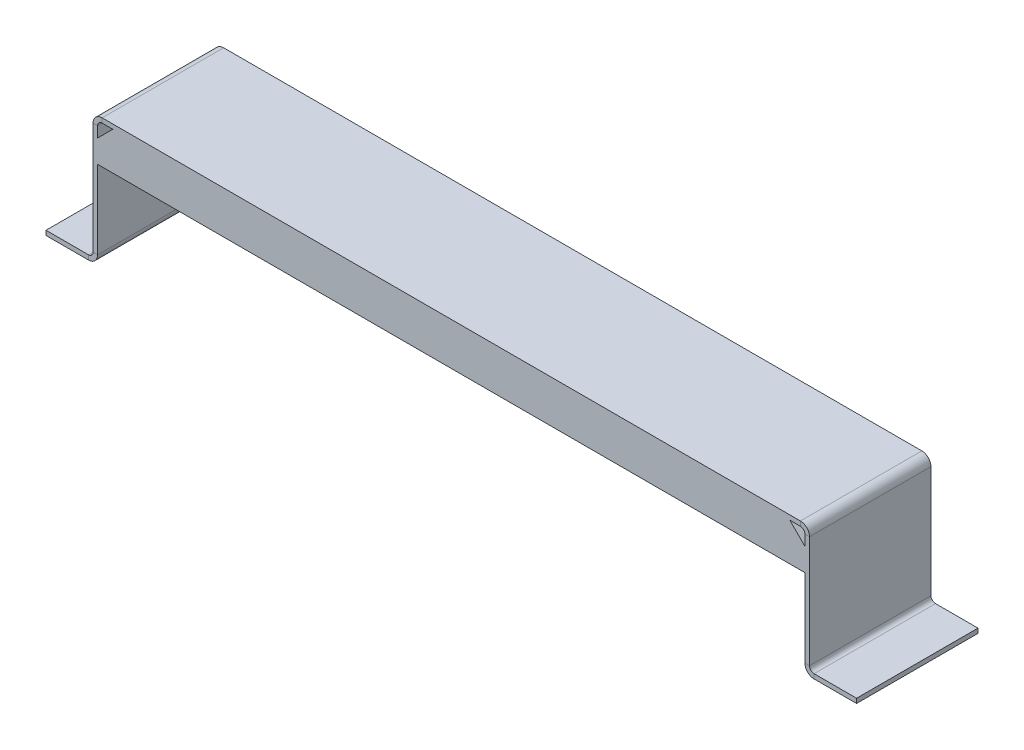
ISO-10303-21;
HEADER;
FILE_DESCRIPTION(('STEP AP214'),'2;1');
FILE_NAME('part.step','',(''),(''),'','','');
FILE_SCHEMA(('AUTOMOTIVE_DESIGN { 1 0 10303 214 1 1 1 1 }'));
ENDSEC;
DATA;
#1=APPLICATION_CONTEXT('core data for automotive mechanical design processes');
#2=APPLICATION_PROTOCOL_DEFINITION('international standard','automotive_design',2000,#1);
#3=PRODUCT_CONTEXT('',#1,'mechanical');
#4=PRODUCT('Part','Part','',(#3));
#5=PRODUCT_RELATED_PRODUCT_CATEGORY('part','',(#4));
#6=PRODUCT_DEFINITION_FORMATION('','',#4);
#7=PRODUCT_DEFINITION_CONTEXT('part definition',#1,'design');
#8=PRODUCT_DEFINITION('design','',#6,#7);
#9=PRODUCT_DEFINITION_SHAPE('','',#8);
#10=(LENGTH_UNIT() NAMED_UNIT(*) SI_UNIT(.MILLI.,.METRE.));
#11=(NAMED_UNIT(*) PLANE_ANGLE_UNIT() SI_UNIT($,.RADIAN.));
#12=(NAMED_UNIT(*) SI_UNIT($,.STERADIAN.) SOLID_ANGLE_UNIT());
#13=UNCERTAINTY_MEASURE_WITH_UNIT(LENGTH_MEASURE(1.E-05),#10,'distance_accuracy_value','');
#14=(GEOMETRIC_REPRESENTATION_CONTEXT(3) GLOBAL_UNCERTAINTY_ASSIGNED_CONTEXT((#13)) GLOBAL_UNIT_ASSIGNED_CONTEXT((#10,
#11,#12)) REPRESENTATION_CONTEXT('',''));
#15=CARTESIAN_POINT('',(0.,0.,0.));
#16=DIRECTION('',(0.,0.,1.));
#17=DIRECTION('',(1.,0.,0.));
#18=AXIS2_PLACEMENT_3D('',#15,#16,#17);
#19=CARTESIAN_POINT('',(42.,106.,-80.));
#20=DIRECTION('',(0.,0.,-1.));
#21=DIRECTION('',(-1.,0.,0.));
#22=AXIS2_PLACEMENT_3D('',#19,#20,#21);
#23=PLANE('',#22);
#24=DIRECTION('',(-1.,0.,0.));
#25=VECTOR('',#24,1.);
#26=CARTESIAN_POINT('',(42.,106.,-80.));
#27=LINE('',#26,#25);
#28=CARTESIAN_POINT('',(42.,106.,-80.));
#29=VERTEX_POINT('',#28);
#30=CARTESIAN_POINT('',(39.,106.,-80.));
#31=VERTEX_POINT('',#30);
#32=EDGE_CURVE('E11',#29,#31,#27,.T.);
#33=ORIENTED_EDGE('',*,*,#32,.F.);
#34=CARTESIAN_POINT('',(36.,106.,-80.));
#35=DIRECTION('',(0.,0.,-1.));
#36=DIRECTION('',(-1.,0.,0.));
#37=AXIS2_PLACEMENT_3D('',#34,#35,#36);
#38=CIRCLE('',#37,6.);
#39=CARTESIAN_POINT('',(36.,100.,-80.));
#40=VERTEX_POINT('',#39);
#41=EDGE_CURVE('E310',#29,#40,#38,.T.);
#42=ORIENTED_EDGE('',*,*,#41,.T.);
#43=DIRECTION('',(0.,-1.,0.));
#44=VECTOR('',#43,1.);
#45=CARTESIAN_POINT('',(36.,103.,-80.));
#46=LINE('',#45,#44);
#47=CARTESIAN_POINT('',(36.,103.,-80.));
#48=VERTEX_POINT('',#47);
#49=EDGE_CURVE('E33',#48,#40,#46,.T.);
#50=ORIENTED_EDGE('',*,*,#49,.F.);
#51=CARTESIAN_POINT('',(36.,106.,-80.));
#52=DIRECTION('',(0.,0.,1.));
#53=DIRECTION('',(1.,0.,0.));
#54=AXIS2_PLACEMENT_3D('',#51,#52,#53);
#55=CIRCLE('',#54,3.);
#56=EDGE_CURVE('E357',#31,#48,#55,.F.);
#57=ORIENTED_EDGE('',*,*,#56,.F.);
#58=EDGE_LOOP('',(#33,#42,#50,#57));
#59=FACE_BOUND('',#58,.T.);
#60=ADVANCED_FACE('F26',(#59),#23,.T.);
#61=CARTESIAN_POINT('',(36.,103.,-80.));
#62=DIRECTION('',(0.,0.,-1.));
#63=DIRECTION('',(-1.,0.,0.));
#64=AXIS2_PLACEMENT_3D('',#61,#62,#63);
#65=PLANE('',#64);
#66=DIRECTION('',(0.,-1.,0.));
#67=VECTOR('',#66,1.);
#68=CARTESIAN_POINT('',(42.,100.,-80.));
#69=LINE('',#68,#67);
#70=CARTESIAN_POINT('',(42.,179.630139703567,-80.));
#71=VERTEX_POINT('',#70);
#72=EDGE_CURVE('E313',#71,#29,#69,.T.);
#73=ORIENTED_EDGE('',*,*,#72,.T.);
#74=ORIENTED_EDGE('',*,*,#32,.T.);
#75=DIRECTION('',(0.,1.,0.));
#76=VECTOR('',#75,1.);
#77=CARTESIAN_POINT('',(39.,100.,-80.));
#78=LINE('',#77,#76);
#79=CARTESIAN_POINT('',(39.,179.630139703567,-80.));
#80=VERTEX_POINT('',#79);
#81=EDGE_CURVE('E354',#80,#31,#78,.F.);
#82=ORIENTED_EDGE('',*,*,#81,.F.);
#83=DIRECTION('',(1.,0.,0.));
#84=VECTOR('',#83,1.);
#85=CARTESIAN_POINT('',(39.,179.630139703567,-80.));
#86=LINE('',#85,#84);
#87=EDGE_CURVE('E437',#80,#71,#86,.T.);
#88=ORIENTED_EDGE('',*,*,#87,.T.);
#89=EDGE_LOOP('',(#73,#74,#82,#88));
#90=FACE_BOUND('',#89,.T.);
#91=ADVANCED_FACE('F479',(#90),#65,.T.);
#92=CARTESIAN_POINT('',(36.,100.,0.));
#93=DIRECTION('',(0.,0.,1.));
#94=DIRECTION('',(1.,0.,0.));
#95=AXIS2_PLACEMENT_3D('',#92,#93,#94);
#96=PLANE('',#95);
#97=DIRECTION('',(0.,1.,0.));
#98=VECTOR('',#97,1.);
#99=CARTESIAN_POINT('',(36.,100.,0.));
#100=LINE('',#99,#98);
#101=CARTESIAN_POINT('',(36.,100.,0.));
#102=VERTEX_POINT('',#101);
#103=CARTESIAN_POINT('',(36.,103.,0.));
#104=VERTEX_POINT('',#103);
#105=EDGE_CURVE('E444',#102,#104,#100,.T.);
#106=ORIENTED_EDGE('',*,*,#105,.F.);
#107=CARTESIAN_POINT('',(36.,106.,0.));
#108=DIRECTION('',(0.,0.,-1.));
#109=DIRECTION('',(-1.,0.,0.));
#110=AXIS2_PLACEMENT_3D('',#107,#108,#109);
#111=CIRCLE('',#110,6.);
#112=CARTESIAN_POINT('',(42.,106.,0.));
#113=VERTEX_POINT('',#112);
#114=EDGE_CURVE('E258',#113,#102,#111,.T.);
#115=ORIENTED_EDGE('',*,*,#114,.F.);
#116=DIRECTION('',(1.,0.,0.));
#117=VECTOR('',#116,1.);
#118=CARTESIAN_POINT('',(39.,106.,0.));
#119=LINE('',#118,#117);
#120=CARTESIAN_POINT('',(39.,106.,0.));
#121=VERTEX_POINT('',#120);
#122=EDGE_CURVE('E441',#121,#113,#119,.T.);
#123=ORIENTED_EDGE('',*,*,#122,.F.);
#124=CARTESIAN_POINT('',(36.,106.,0.));
#125=DIRECTION('',(0.,0.,1.));
#126=DIRECTION('',(1.,0.,0.));
#127=AXIS2_PLACEMENT_3D('',#124,#125,#126);
#128=CIRCLE('',#127,3.);
#129=EDGE_CURVE('E300',#121,#104,#128,.F.);
#130=ORIENTED_EDGE('',*,*,#129,.T.);
#131=EDGE_LOOP('',(#106,#115,#123,#130));
#132=FACE_BOUND('',#131,.T.);
#133=ADVANCED_FACE('F554',(#132),#96,.T.);
#134=CARTESIAN_POINT('',(39.,106.,0.));
#135=DIRECTION('',(0.,0.,1.));
#136=DIRECTION('',(1.,0.,0.));
#137=AXIS2_PLACEMENT_3D('',#134,#135,#136);
#138=PLANE('',#137);
#139=DIRECTION('',(-1.,0.,0.));
#140=VECTOR('',#139,1.);
#141=CARTESIAN_POINT('',(7.99999999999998,100.,0.));
#142=LINE('',#141,#140);
#143=CARTESIAN_POINT('',(7.99999999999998,100.,0.));
#144=VERTEX_POINT('',#143);
#145=EDGE_CURVE('E256',#102,#144,#142,.T.);
#146=ORIENTED_EDGE('',*,*,#145,.F.);
#147=ORIENTED_EDGE('',*,*,#105,.T.);
#148=DIRECTION('',(1.,0.,0.));
#149=VECTOR('',#148,1.);
#150=CARTESIAN_POINT('',(7.99999999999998,103.,0.));
#151=LINE('',#150,#149);
#152=CARTESIAN_POINT('',(7.99999999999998,103.,0.));
#153=VERTEX_POINT('',#152);
#154=EDGE_CURVE('E242',#104,#153,#151,.F.);
#155=ORIENTED_EDGE('',*,*,#154,.T.);
#156=DIRECTION('',(0.,1.,0.));
#157=VECTOR('',#156,1.);
#158=CARTESIAN_POINT('',(7.99999999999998,100.,0.));
#159=LINE('',#158,#157);
#160=EDGE_CURVE('E253',#144,#153,#159,.T.);
#161=ORIENTED_EDGE('',*,*,#160,.F.);
#162=EDGE_LOOP('',(#146,#147,#155,#161));
#163=FACE_BOUND('',#162,.T.);
#164=ADVANCED_FACE('F556',(#163),#138,.T.);
#165=CARTESIAN_POINT('',(44.9999999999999,182.630139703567,-80.));
#166=DIRECTION('',(0.,0.,-1.));
#167=DIRECTION('',(-1.,0.,0.));
#168=AXIS2_PLACEMENT_3D('',#165,#166,#167);
#169=PLANE('',#168);
#170=DIRECTION('',(0.,1.,0.));
#171=VECTOR('',#170,1.);
#172=CARTESIAN_POINT('',(44.9999999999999,182.630139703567,-80.));
#173=LINE('',#172,#171);
#174=CARTESIAN_POINT('',(44.9999999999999,182.630139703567,-80.));
#175=VERTEX_POINT('',#174);
#176=CARTESIAN_POINT('',(44.9999999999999,185.630139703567,-80.));
#177=VERTEX_POINT('',#176);
#178=EDGE_CURVE('E439',#175,#177,#173,.T.);
#179=ORIENTED_EDGE('',*,*,#178,.F.);
#180=CARTESIAN_POINT('',(44.9999999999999,179.630139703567,-80.));
#181=DIRECTION('',(0.,0.,1.));
#182=DIRECTION('',(1.,0.,0.));
#183=AXIS2_PLACEMENT_3D('',#180,#181,#182);
#184=CIRCLE('',#183,3.);
#185=EDGE_CURVE('E316',#175,#71,#184,.T.);
#186=ORIENTED_EDGE('',*,*,#185,.T.);
#187=ORIENTED_EDGE('',*,*,#87,.F.);
#188=CARTESIAN_POINT('',(44.9999999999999,179.630139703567,-80.));
#189=DIRECTION('',(0.,0.,1.));
#190=DIRECTION('',(1.,0.,0.));
#191=AXIS2_PLACEMENT_3D('',#188,#189,#190);
#192=CIRCLE('',#191,6.);
#193=EDGE_CURVE('E351',#177,#80,#192,.T.);
#194=ORIENTED_EDGE('',*,*,#193,.F.);
#195=EDGE_LOOP('',(#179,#186,#187,#194));
#196=FACE_BOUND('',#195,.T.);
#197=ADVANCED_FACE('F486',(#196),#169,.T.);
#198=CARTESIAN_POINT('',(39.,179.630139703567,-80.));
#199=DIRECTION('',(0.,0.,-1.));
#200=DIRECTION('',(-1.,0.,0.));
#201=AXIS2_PLACEMENT_3D('',#198,#199,#200);
#202=PLANE('',#201);
#203=DIRECTION('',(-1.,0.,0.));
#204=VECTOR('',#203,1.);
#205=CARTESIAN_POINT('',(508.000000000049,182.630139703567,-80.));
#206=LINE('',#205,#204);
#207=CARTESIAN_POINT('',(505.000000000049,182.630139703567,-80.));
#208=VERTEX_POINT('',#207);
#209=EDGE_CURVE('E319',#208,#175,#206,.T.);
#210=ORIENTED_EDGE('',*,*,#209,.T.);
#211=ORIENTED_EDGE('',*,*,#178,.T.);
#212=DIRECTION('',(1.,0.,0.));
#213=VECTOR('',#212,1.);
#214=CARTESIAN_POINT('',(508.000000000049,185.630139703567,-80.));
#215=LINE('',#214,#213);
#216=CARTESIAN_POINT('',(505.000000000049,185.630139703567,-80.));
#217=VERTEX_POINT('',#216);
#218=EDGE_CURVE('E348',#217,#177,#215,.F.);
#219=ORIENTED_EDGE('',*,*,#218,.F.);
#220=DIRECTION('',(0.,-1.,0.));
#221=VECTOR('',#220,1.);
#222=CARTESIAN_POINT('',(505.000000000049,185.630139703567,-80.));
#223=LINE('',#222,#221);
#224=EDGE_CURVE('E428',#217,#208,#223,.T.);
#225=ORIENTED_EDGE('',*,*,#224,.T.);
#226=EDGE_LOOP('',(#210,#211,#219,#225));
#227=FACE_BOUND('',#226,.T.);
#228=ADVANCED_FACE('F493',(#227),#202,.T.);
#229=CARTESIAN_POINT('',(42.,179.630139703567,0.));
#230=DIRECTION('',(0.,0.,1.));
#231=DIRECTION('',(1.,0.,0.));
#232=AXIS2_PLACEMENT_3D('',#229,#230,#231);
#233=PLANE('',#232);
#234=DIRECTION('',(-1.,0.,0.));
#235=VECTOR('',#234,1.);
#236=CARTESIAN_POINT('',(42.,179.630139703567,0.));
#237=LINE('',#236,#235);
#238=CARTESIAN_POINT('',(42.,179.630139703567,0.));
#239=VERTEX_POINT('',#238);
#240=CARTESIAN_POINT('',(39.,179.630139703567,0.));
#241=VERTEX_POINT('',#240);
#242=EDGE_CURVE('E435',#239,#241,#237,.T.);
#243=ORIENTED_EDGE('',*,*,#242,.F.);
#244=CARTESIAN_POINT('',(44.9999999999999,179.630139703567,0.));
#245=DIRECTION('',(0.,0.,1.));
#246=DIRECTION('',(1.,0.,0.));
#247=AXIS2_PLACEMENT_3D('',#244,#245,#246);
#248=CIRCLE('',#247,3.);
#249=CARTESIAN_POINT('',(44.9999999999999,182.630139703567,0.));
#250=VERTEX_POINT('',#249);
#251=EDGE_CURVE('E264',#250,#239,#248,.T.);
#252=ORIENTED_EDGE('',*,*,#251,.F.);
#253=DIRECTION('',(0.,-1.,0.));
#254=VECTOR('',#253,1.);
#255=CARTESIAN_POINT('',(44.9999999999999,185.630139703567,0.));
#256=LINE('',#255,#254);
#257=CARTESIAN_POINT('',(44.9999999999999,185.630139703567,0.));
#258=VERTEX_POINT('',#257);
#259=EDGE_CURVE('E432',#258,#250,#256,.T.);
#260=ORIENTED_EDGE('',*,*,#259,.F.);
#261=CARTESIAN_POINT('',(44.9999999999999,179.630139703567,0.));
#262=DIRECTION('',(0.,0.,1.));
#263=DIRECTION('',(1.,0.,0.));
#264=AXIS2_PLACEMENT_3D('',#261,#262,#263);
#265=CIRCLE('',#264,6.);
#266=EDGE_CURVE('E294',#258,#241,#265,.T.);
#267=ORIENTED_EDGE('',*,*,#266,.T.);
#268=EDGE_LOOP('',(#243,#252,#260,#267));
#269=FACE_BOUND('',#268,.T.);
#270=ADVANCED_FACE('F600',(#269),#233,.T.);
#271=CARTESIAN_POINT('',(508.000000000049,179.630139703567,-80.));
#272=DIRECTION('',(0.,0.,-1.));
#273=DIRECTION('',(-1.,0.,0.));
#274=AXIS2_PLACEMENT_3D('',#271,#272,#273);
#275=PLANE('',#274);
#276=DIRECTION('',(1.,0.,0.));
#277=VECTOR('',#276,1.);
#278=CARTESIAN_POINT('',(508.000000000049,179.630139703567,-80.));
#279=LINE('',#278,#277);
#280=CARTESIAN_POINT('',(508.000000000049,179.630139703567,-80.));
#281=VERTEX_POINT('',#280);
#282=CARTESIAN_POINT('',(511.000000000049,179.630139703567,-80.));
#283=VERTEX_POINT('',#282);
#284=EDGE_CURVE('E430',#281,#283,#279,.T.);
#285=ORIENTED_EDGE('',*,*,#284,.F.);
#286=CARTESIAN_POINT('',(505.000000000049,179.630139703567,-80.));
#287=DIRECTION('',(0.,0.,1.));
#288=DIRECTION('',(1.,0.,0.));
#289=AXIS2_PLACEMENT_3D('',#286,#287,#288);
#290=CIRCLE('',#289,3.);
#291=EDGE_CURVE('E322',#281,#208,#290,.T.);
#292=ORIENTED_EDGE('',*,*,#291,.T.);
#293=ORIENTED_EDGE('',*,*,#224,.F.);
#294=CARTESIAN_POINT('',(505.000000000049,179.630139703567,-80.));
#295=DIRECTION('',(0.,0.,1.));
#296=DIRECTION('',(1.,0.,0.));
#297=AXIS2_PLACEMENT_3D('',#294,#295,#296);
#298=CIRCLE('',#297,6.);
#299=EDGE_CURVE('E345',#283,#217,#298,.T.);
#300=ORIENTED_EDGE('',*,*,#299,.F.);
#301=EDGE_LOOP('',(#285,#292,#293,#300));
#302=FACE_BOUND('',#301,.T.);
#303=ADVANCED_FACE('F500',(#302),#275,.T.);
#304=CARTESIAN_POINT('',(505.000000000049,185.630139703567,-80.));
#305=DIRECTION('',(0.,0.,-1.));
#306=DIRECTION('',(-1.,0.,0.));
#307=AXIS2_PLACEMENT_3D('',#304,#305,#306);
#308=PLANE('',#307);
#309=DIRECTION('',(0.,1.,0.));
#310=VECTOR('',#309,1.);
#311=CARTESIAN_POINT('',(508.000000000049,100.000000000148,-80.));
#312=LINE('',#311,#310);
#313=CARTESIAN_POINT('',(508.000000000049,106.000000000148,-80.));
#314=VERTEX_POINT('',#313);
#315=EDGE_CURVE('E325',#314,#281,#312,.T.);
#316=ORIENTED_EDGE('',*,*,#315,.T.);
#317=ORIENTED_EDGE('',*,*,#284,.T.);
#318=DIRECTION('',(0.,1.,0.));
#319=VECTOR('',#318,1.);
#320=CARTESIAN_POINT('',(511.000000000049,100.000000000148,-80.));
#321=LINE('',#320,#319);
#322=CARTESIAN_POINT('',(511.000000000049,106.000000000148,-80.));
#323=VERTEX_POINT('',#322);
#324=EDGE_CURVE('E342',#323,#283,#321,.T.);
#325=ORIENTED_EDGE('',*,*,#324,.F.);
#326=DIRECTION('',(-1.,0.,0.));
#327=VECTOR('',#326,1.);
#328=CARTESIAN_POINT('',(511.000000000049,106.000000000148,-80.));
#329=LINE('',#328,#327);
#330=EDGE_CURVE('E421',#323,#314,#329,.T.);
#331=ORIENTED_EDGE('',*,*,#330,.T.);
#332=EDGE_LOOP('',(#316,#317,#325,#331));
#333=FACE_BOUND('',#332,.T.);
#334=ADVANCED_FACE('F507',(#333),#308,.T.);
#335=CARTESIAN_POINT('',(505.000000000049,182.630139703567,0.));
#336=DIRECTION('',(0.,0.,1.));
#337=DIRECTION('',(1.,0.,0.));
#338=AXIS2_PLACEMENT_3D('',#335,#336,#337);
#339=PLANE('',#338);
#340=DIRECTION('',(0.,1.,0.));
#341=VECTOR('',#340,1.);
#342=CARTESIAN_POINT('',(505.000000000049,182.630139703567,0.));
#343=LINE('',#342,#341);
#344=CARTESIAN_POINT('',(505.000000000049,182.630139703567,0.));
#345=VERTEX_POINT('',#344);
#346=CARTESIAN_POINT('',(505.000000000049,185.630139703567,0.));
#347=VERTEX_POINT('',#346);
#348=EDGE_CURVE('E426',#345,#347,#343,.T.);
#349=ORIENTED_EDGE('',*,*,#348,.F.);
#350=CARTESIAN_POINT('',(505.000000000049,179.630139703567,0.));
#351=DIRECTION('',(0.,0.,1.));
#352=DIRECTION('',(1.,0.,0.));
#353=AXIS2_PLACEMENT_3D('',#350,#351,#352);
#354=CIRCLE('',#353,3.);
#355=CARTESIAN_POINT('',(508.000000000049,179.630139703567,0.));
#356=VERTEX_POINT('',#355);
#357=EDGE_CURVE('E207',#356,#345,#354,.T.);
#358=ORIENTED_EDGE('',*,*,#357,.F.);
#359=DIRECTION('',(-1.,0.,0.));
#360=VECTOR('',#359,1.);
#361=CARTESIAN_POINT('',(511.000000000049,179.630139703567,0.));
#362=LINE('',#361,#360);
#363=CARTESIAN_POINT('',(511.000000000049,179.630139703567,0.));
#364=VERTEX_POINT('',#363);
#365=EDGE_CURVE('E203',#364,#356,#362,.T.);
#366=ORIENTED_EDGE('',*,*,#365,.F.);
#367=CARTESIAN_POINT('',(505.000000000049,179.630139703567,0.));
#368=DIRECTION('',(0.,0.,1.));
#369=DIRECTION('',(1.,0.,0.));
#370=AXIS2_PLACEMENT_3D('',#367,#368,#369);
#371=CIRCLE('',#370,6.);
#372=EDGE_CURVE('E288',#364,#347,#371,.T.);
#373=ORIENTED_EDGE('',*,*,#372,.T.);
#374=EDGE_LOOP('',(#349,#358,#366,#373));
#375=FACE_BOUND('',#374,.T.);
#376=ADVANCED_FACE('F628',(#375),#339,.T.);
#377=CARTESIAN_POINT('',(514.000000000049,100.000000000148,-80.));
#378=DIRECTION('',(0.,0.,-1.));
#379=DIRECTION('',(-1.,0.,0.));
#380=AXIS2_PLACEMENT_3D('',#377,#378,#379);
#381=PLANE('',#380);
#382=DIRECTION('',(0.,1.,0.));
#383=VECTOR('',#382,1.);
#384=CARTESIAN_POINT('',(514.000000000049,100.000000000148,-80.));
#385=LINE('',#384,#383);
#386=CARTESIAN_POINT('',(514.000000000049,100.000000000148,-80.));
#387=VERTEX_POINT('',#386);
#388=CARTESIAN_POINT('',(514.000000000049,103.000000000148,-80.));
#389=VERTEX_POINT('',#388);
#390=EDGE_CURVE('E423',#387,#389,#385,.T.);
#391=ORIENTED_EDGE('',*,*,#390,.F.);
#392=CARTESIAN_POINT('',(514.000000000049,106.000000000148,-80.));
#393=DIRECTION('',(0.,0.,-1.));
#394=DIRECTION('',(-1.,0.,0.));
#395=AXIS2_PLACEMENT_3D('',#392,#393,#394);
#396=CIRCLE('',#395,6.);
#397=EDGE_CURVE('E328',#387,#314,#396,.T.);
#398=ORIENTED_EDGE('',*,*,#397,.T.);
#399=ORIENTED_EDGE('',*,*,#330,.F.);
#400=CARTESIAN_POINT('',(514.000000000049,106.000000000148,-80.));
#401=DIRECTION('',(0.,0.,1.));
#402=DIRECTION('',(1.,0.,0.));
#403=AXIS2_PLACEMENT_3D('',#400,#401,#402);
#404=CIRCLE('',#403,3.);
#405=EDGE_CURVE('E339',#389,#323,#404,.F.);
#406=ORIENTED_EDGE('',*,*,#405,.F.);
#407=EDGE_LOOP('',(#391,#398,#399,#406));
#408=FACE_BOUND('',#407,.T.);
#409=ADVANCED_FACE('F514',(#408),#381,.T.);
#410=CARTESIAN_POINT('',(511.000000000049,106.000000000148,-80.));
#411=DIRECTION('',(0.,0.,-1.));
#412=DIRECTION('',(-1.,0.,0.));
#413=AXIS2_PLACEMENT_3D('',#410,#411,#412);
#414=PLANE('',#413);
#415=DIRECTION('',(-1.,0.,0.));
#416=VECTOR('',#415,1.);
#417=CARTESIAN_POINT('',(542.000000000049,100.000000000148,-80.));
#418=LINE('',#417,#416);
#419=CARTESIAN_POINT('',(542.000000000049,100.000000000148,-80.));
#420=VERTEX_POINT('',#419);
#421=EDGE_CURVE('E331',#420,#387,#418,.T.);
#422=ORIENTED_EDGE('',*,*,#421,.T.);
#423=ORIENTED_EDGE('',*,*,#390,.T.);
#424=DIRECTION('',(-1.,0.,0.));
#425=VECTOR('',#424,1.);
#426=CARTESIAN_POINT('',(542.000000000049,103.000000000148,-80.));
#427=LINE('',#426,#425);
#428=CARTESIAN_POINT('',(542.000000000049,103.000000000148,-80.));
#429=VERTEX_POINT('',#428);
#430=EDGE_CURVE('E336',#429,#389,#427,.T.);
#431=ORIENTED_EDGE('',*,*,#430,.F.);
#432=DIRECTION('',(0.,-1.,0.));
#433=VECTOR('',#432,1.);
#434=CARTESIAN_POINT('',(542.000000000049,103.000000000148,-80.));
#435=LINE('',#434,#433);
#436=EDGE_CURVE('E334',#429,#420,#435,.T.);
#437=ORIENTED_EDGE('',*,*,#436,.T.);
#438=EDGE_LOOP('',(#422,#423,#431,#437));
#439=FACE_BOUND('',#438,.T.);
#440=ADVANCED_FACE('F521',(#439),#414,.T.);
#441=CARTESIAN_POINT('',(508.000000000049,106.000000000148,0.));
#442=DIRECTION('',(0.,0.,1.));
#443=DIRECTION('',(1.,0.,0.));
#444=AXIS2_PLACEMENT_3D('',#441,#442,#443);
#445=PLANE('',#444);
#446=DIRECTION('',(1.,0.,0.));
#447=VECTOR('',#446,1.);
#448=CARTESIAN_POINT('',(508.000000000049,106.000000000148,0.));
#449=LINE('',#448,#447);
#450=CARTESIAN_POINT('',(508.000000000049,106.000000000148,0.));
#451=VERTEX_POINT('',#450);
#452=CARTESIAN_POINT('',(511.000000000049,106.000000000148,0.));
#453=VERTEX_POINT('',#452);
#454=EDGE_CURVE('E419',#451,#453,#449,.T.);
#455=ORIENTED_EDGE('',*,*,#454,.F.);
#456=CARTESIAN_POINT('',(514.000000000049,106.000000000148,0.));
#457=DIRECTION('',(0.,0.,-1.));
#458=DIRECTION('',(-1.,0.,0.));
#459=AXIS2_PLACEMENT_3D('',#456,#457,#458);
#460=CIRCLE('',#459,6.);
#461=CARTESIAN_POINT('',(514.000000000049,100.000000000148,0.));
#462=VERTEX_POINT('',#461);
#463=EDGE_CURVE('E272',#462,#451,#460,.T.);
#464=ORIENTED_EDGE('',*,*,#463,.F.);
#465=DIRECTION('',(0.,-1.,0.));
#466=VECTOR('',#465,1.);
#467=CARTESIAN_POINT('',(514.000000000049,103.000000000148,0.));
#468=LINE('',#467,#466);
#469=CARTESIAN_POINT('',(514.000000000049,103.000000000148,0.));
#470=VERTEX_POINT('',#469);
#471=EDGE_CURVE('E364',#470,#462,#468,.T.);
#472=ORIENTED_EDGE('',*,*,#471,.F.);
#473=CARTESIAN_POINT('',(514.000000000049,106.000000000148,0.));
#474=DIRECTION('',(0.,0.,1.));
#475=DIRECTION('',(1.,0.,0.));
#476=AXIS2_PLACEMENT_3D('',#473,#474,#475);
#477=CIRCLE('',#476,3.);
#478=EDGE_CURVE('E283',#470,#453,#477,.F.);
#479=ORIENTED_EDGE('',*,*,#478,.T.);
#480=EDGE_LOOP('',(#455,#464,#472,#479));
#481=FACE_BOUND('',#480,.T.);
#482=ADVANCED_FACE('F656',(#481),#445,.T.);
#483=CARTESIAN_POINT('',(514.000000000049,103.000000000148,0.));
#484=DIRECTION('',(0.,0.,1.));
#485=DIRECTION('',(1.,0.,0.));
#486=AXIS2_PLACEMENT_3D('',#483,#484,#485);
#487=PLANE('',#486);
#488=DIRECTION('',(0.,1.,0.));
#489=VECTOR('',#488,1.);
#490=CARTESIAN_POINT('',(508.000000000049,100.000000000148,0.));
#491=LINE('',#490,#489);
#492=CARTESIAN_POINT('',(508.000000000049,157.630139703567,0.));
#493=VERTEX_POINT('',#492);
#494=EDGE_CURVE('E206',#451,#493,#491,.T.);
#495=ORIENTED_EDGE('',*,*,#494,.F.);
#496=ORIENTED_EDGE('',*,*,#454,.T.);
#497=DIRECTION('',(0.,1.,0.));
#498=VECTOR('',#497,1.);
#499=CARTESIAN_POINT('',(511.000000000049,100.000000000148,0.));
#500=LINE('',#499,#498);
#501=EDGE_CURVE('E286',#453,#364,#500,.T.);
#502=ORIENTED_EDGE('',*,*,#501,.T.);
#503=ORIENTED_EDGE('',*,*,#365,.T.);
#504=CARTESIAN_POINT('',(508.000000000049,172.630139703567,0.));
#505=VERTEX_POINT('',#504);
#506=EDGE_CURVE('E196',#505,#356,#491,.T.);
#507=ORIENTED_EDGE('',*,*,#506,.F.);
#508=DIRECTION('',(-0.707106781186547,0.707106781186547,0.));
#509=VECTOR('',#508,1.);
#510=CARTESIAN_POINT('',(498.000000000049,182.630139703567,0.));
#511=LINE('',#510,#509);
#512=CARTESIAN_POINT('',(498.000000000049,182.630139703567,0.));
#513=VERTEX_POINT('',#512);
#514=EDGE_CURVE('E201',#505,#513,#511,.T.);
#515=ORIENTED_EDGE('',*,*,#514,.T.);
#516=DIRECTION('',(-1.,0.,0.));
#517=VECTOR('',#516,1.);
#518=CARTESIAN_POINT('',(508.000000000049,182.630139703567,0.));
#519=LINE('',#518,#517);
#520=EDGE_CURVE('E268',#345,#513,#519,.T.);
#521=ORIENTED_EDGE('',*,*,#520,.F.);
#522=ORIENTED_EDGE('',*,*,#348,.T.);
#523=DIRECTION('',(1.,0.,0.));
#524=VECTOR('',#523,1.);
#525=CARTESIAN_POINT('',(508.000000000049,185.630139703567,0.));
#526=LINE('',#525,#524);
#527=EDGE_CURVE('E291',#347,#258,#526,.F.);
#528=ORIENTED_EDGE('',*,*,#527,.T.);
#529=ORIENTED_EDGE('',*,*,#259,.T.);
#530=CARTESIAN_POINT('',(52.,182.630139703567,0.));
#531=VERTEX_POINT('',#530);
#532=EDGE_CURVE('E267',#531,#250,#519,.T.);
#533=ORIENTED_EDGE('',*,*,#532,.F.);
#534=DIRECTION('',(-0.707106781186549,-0.707106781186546,0.));
#535=VECTOR('',#534,1.);
#536=CARTESIAN_POINT('',(42.,172.630139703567,0.));
#537=LINE('',#536,#535);
#538=CARTESIAN_POINT('',(42.,172.630139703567,0.));
#539=VERTEX_POINT('',#538);
#540=EDGE_CURVE('E218',#531,#539,#537,.T.);
#541=ORIENTED_EDGE('',*,*,#540,.T.);
#542=DIRECTION('',(0.,-1.,0.));
#543=VECTOR('',#542,1.);
#544=CARTESIAN_POINT('',(42.,100.,0.));
#545=LINE('',#544,#543);
#546=EDGE_CURVE('E262',#239,#539,#545,.T.);
#547=ORIENTED_EDGE('',*,*,#546,.F.);
#548=ORIENTED_EDGE('',*,*,#242,.T.);
#549=DIRECTION('',(0.,1.,0.));
#550=VECTOR('',#549,1.);
#551=CARTESIAN_POINT('',(39.,100.,0.));
#552=LINE('',#551,#550);
#553=EDGE_CURVE('E297',#241,#121,#552,.F.);
#554=ORIENTED_EDGE('',*,*,#553,.T.);
#555=ORIENTED_EDGE('',*,*,#122,.T.);
#556=CARTESIAN_POINT('',(42.,157.630139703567,0.));
#557=VERTEX_POINT('',#556);
#558=EDGE_CURVE('E261',#557,#113,#545,.T.);
#559=ORIENTED_EDGE('',*,*,#558,.F.);
#560=DIRECTION('',(1.,0.,0.));
#561=VECTOR('',#560,1.);
#562=CARTESIAN_POINT('',(508.000000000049,157.630139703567,0.));
#563=LINE('',#562,#561);
#564=EDGE_CURVE('E219',#557,#493,#563,.T.);
#565=ORIENTED_EDGE('',*,*,#564,.T.);
#566=EDGE_LOOP('',(#495,#496,#502,#503,#507,#515,#521,#522,#528,#529,#533,#541,#547,#548,#554,
#555,#559,#565));
#567=FACE_BOUND('',#566,.T.);
#568=ADVANCED_FACE('F198',(#567),#487,.T.);
#569=CARTESIAN_POINT('',(7.99999999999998,103.,-80.));
#570=DIRECTION('',(0.,1.,0.));
#571=DIRECTION('',(0.,0.,1.));
#572=AXIS2_PLACEMENT_3D('',#569,#570,#571);
#573=PLANE('',#572);
#574=ORIENTED_EDGE('',*,*,#154,.F.);
#575=DIRECTION('',(0.,0.,1.));
#576=VECTOR('',#575,1.);
#577=CARTESIAN_POINT('',(36.,103.,-80.));
#578=LINE('',#577,#576);
#579=EDGE_CURVE('E361',#48,#104,#578,.T.);
#580=ORIENTED_EDGE('',*,*,#579,.F.);
#581=DIRECTION('',(1.,0.,0.));
#582=VECTOR('',#581,1.);
#583=CARTESIAN_POINT('',(7.99999999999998,103.,-80.));
#584=LINE('',#583,#582);
#585=CARTESIAN_POINT('',(7.99999999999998,103.,-80.));
#586=VERTEX_POINT('',#585);
#587=EDGE_CURVE('E303',#48,#586,#584,.F.);
#588=ORIENTED_EDGE('',*,*,#587,.T.);
#589=DIRECTION('',(0.,0.,1.));
#590=VECTOR('',#589,1.);
#591=CARTESIAN_POINT('',(7.99999999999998,103.,-80.));
#592=LINE('',#591,#590);
#593=EDGE_CURVE('E360',#586,#153,#592,.T.);
#594=ORIENTED_EDGE('',*,*,#593,.T.);
#595=EDGE_LOOP('',(#574,#580,#588,#594));
#596=FACE_BOUND('',#595,.T.);
#597=ADVANCED_FACE('F468',(#596),#573,.T.);
#598=CARTESIAN_POINT('',(36.,106.,-80.));
#599=DIRECTION('',(0.,0.,1.));
#600=DIRECTION('',(1.,0.,0.));
#601=AXIS2_PLACEMENT_3D('',#598,#599,#600);
#602=CYLINDRICAL_SURFACE('',#601,3.);
#603=ORIENTED_EDGE('',*,*,#129,.F.);
#604=DIRECTION('',(0.,0.,1.));
#605=VECTOR('',#604,1.);
#606=CARTESIAN_POINT('',(39.,106.,-80.));
#607=LINE('',#606,#605);
#608=EDGE_CURVE('E365',#31,#121,#607,.T.);
#609=ORIENTED_EDGE('',*,*,#608,.F.);
#610=ORIENTED_EDGE('',*,*,#56,.T.);
#611=ORIENTED_EDGE('',*,*,#579,.T.);
#612=EDGE_LOOP('',(#603,#609,#610,#611));
#613=FACE_BOUND('',#612,.T.);
#614=ADVANCED_FACE('F471',(#613),#602,.F.);
#615=CARTESIAN_POINT('',(39.,100.,-80.));
#616=DIRECTION('',(-1.,0.,0.));
#617=DIRECTION('',(0.,0.,1.));
#618=AXIS2_PLACEMENT_3D('',#615,#616,#617);
#619=PLANE('',#618);
#620=ORIENTED_EDGE('',*,*,#553,.F.);
#621=DIRECTION('',(0.,0.,1.));
#622=VECTOR('',#621,1.);
#623=CARTESIAN_POINT('',(39.,179.630139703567,-80.));
#624=LINE('',#623,#622);
#625=EDGE_CURVE('E368',#80,#241,#624,.T.);
#626=ORIENTED_EDGE('',*,*,#625,.F.);
#627=ORIENTED_EDGE('',*,*,#81,.T.);
#628=ORIENTED_EDGE('',*,*,#608,.T.);
#629=EDGE_LOOP('',(#620,#626,#627,#628));
#630=FACE_BOUND('',#629,.T.);
#631=ADVANCED_FACE('F477',(#630),#619,.T.);
#632=CARTESIAN_POINT('',(44.9999999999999,179.630139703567,-80.));
#633=DIRECTION('',(0.,0.,1.));
#634=DIRECTION('',(1.,0.,0.));
#635=AXIS2_PLACEMENT_3D('',#632,#633,#634);
#636=CYLINDRICAL_SURFACE('',#635,6.);
#637=ORIENTED_EDGE('',*,*,#266,.F.);
#638=DIRECTION('',(0.,0.,1.));
#639=VECTOR('',#638,1.);
#640=CARTESIAN_POINT('',(44.9999999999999,185.630139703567,-80.));
#641=LINE('',#640,#639);
#642=EDGE_CURVE('E371',#177,#258,#641,.T.);
#643=ORIENTED_EDGE('',*,*,#642,.F.);
#644=ORIENTED_EDGE('',*,*,#193,.T.);
#645=ORIENTED_EDGE('',*,*,#625,.T.);
#646=EDGE_LOOP('',(#637,#643,#644,#645));
#647=FACE_BOUND('',#646,.T.);
#648=ADVANCED_FACE('F484',(#647),#636,.T.);
#649=CARTESIAN_POINT('',(508.000000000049,185.630139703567,-80.));
#650=DIRECTION('',(0.,1.,0.));
#651=DIRECTION('',(0.,0.,1.));
#652=AXIS2_PLACEMENT_3D('',#649,#650,#651);
#653=PLANE('',#652);
#654=ORIENTED_EDGE('',*,*,#527,.F.);
#655=DIRECTION('',(0.,0.,1.));
#656=VECTOR('',#655,1.);
#657=CARTESIAN_POINT('',(505.000000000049,185.630139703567,-80.));
#658=LINE('',#657,#656);
#659=EDGE_CURVE('E374',#217,#347,#658,.T.);
#660=ORIENTED_EDGE('',*,*,#659,.F.);
#661=ORIENTED_EDGE('',*,*,#218,.T.);
#662=ORIENTED_EDGE('',*,*,#642,.T.);
#663=EDGE_LOOP('',(#654,#660,#661,#662));
#664=FACE_BOUND('',#663,.T.);
#665=ADVANCED_FACE('F491',(#664),#653,.T.);
#666=CARTESIAN_POINT('',(505.000000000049,179.630139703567,-80.));
#667=DIRECTION('',(0.,0.,1.));
#668=DIRECTION('',(1.,0.,0.));
#669=AXIS2_PLACEMENT_3D('',#666,#667,#668);
#670=CYLINDRICAL_SURFACE('',#669,6.);
#671=ORIENTED_EDGE('',*,*,#372,.F.);
#672=DIRECTION('',(0.,0.,1.));
#673=VECTOR('',#672,1.);
#674=CARTESIAN_POINT('',(511.000000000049,179.630139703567,-80.));
#675=LINE('',#674,#673);
#676=EDGE_CURVE('E377',#283,#364,#675,.T.);
#677=ORIENTED_EDGE('',*,*,#676,.F.);
#678=ORIENTED_EDGE('',*,*,#299,.T.);
#679=ORIENTED_EDGE('',*,*,#659,.T.);
#680=EDGE_LOOP('',(#671,#677,#678,#679));
#681=FACE_BOUND('',#680,.T.);
#682=ADVANCED_FACE('F498',(#681),#670,.T.);
#683=CARTESIAN_POINT('',(511.000000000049,100.000000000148,-80.));
#684=DIRECTION('',(1.,0.,0.));
#685=DIRECTION('',(0.,0.,-1.));
#686=AXIS2_PLACEMENT_3D('',#683,#684,#685);
#687=PLANE('',#686);
#688=ORIENTED_EDGE('',*,*,#501,.F.);
#689=DIRECTION('',(0.,0.,1.));
#690=VECTOR('',#689,1.);
#691=CARTESIAN_POINT('',(511.000000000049,106.000000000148,-80.));
#692=LINE('',#691,#690);
#693=EDGE_CURVE('E380',#323,#453,#692,.T.);
#694=ORIENTED_EDGE('',*,*,#693,.F.);
#695=ORIENTED_EDGE('',*,*,#324,.T.);
#696=ORIENTED_EDGE('',*,*,#676,.T.);
#697=EDGE_LOOP('',(#688,#694,#695,#696));
#698=FACE_BOUND('',#697,.T.);
#699=ADVANCED_FACE('F505',(#698),#687,.T.);
#700=CARTESIAN_POINT('',(514.000000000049,106.000000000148,-80.));
#701=DIRECTION('',(0.,0.,1.));
#702=DIRECTION('',(1.,0.,0.));
#703=AXIS2_PLACEMENT_3D('',#700,#701,#702);
#704=CYLINDRICAL_SURFACE('',#703,3.);
#705=ORIENTED_EDGE('',*,*,#478,.F.);
#706=DIRECTION('',(0.,0.,1.));
#707=VECTOR('',#706,1.);
#708=CARTESIAN_POINT('',(514.000000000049,103.000000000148,-80.));
#709=LINE('',#708,#707);
#710=EDGE_CURVE('E383',#389,#470,#709,.T.);
#711=ORIENTED_EDGE('',*,*,#710,.F.);
#712=ORIENTED_EDGE('',*,*,#405,.T.);
#713=ORIENTED_EDGE('',*,*,#693,.T.);
#714=EDGE_LOOP('',(#705,#711,#712,#713));
#715=FACE_BOUND('',#714,.T.);
#716=ADVANCED_FACE('F512',(#715),#704,.F.);
#717=CARTESIAN_POINT('',(542.000000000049,103.000000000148,-80.));
#718=DIRECTION('',(0.,1.,0.));
#719=DIRECTION('',(-1.,0.,0.));
#720=AXIS2_PLACEMENT_3D('',#717,#718,#719);
#721=PLANE('',#720);
#722=DIRECTION('',(-1.,0.,0.));
#723=VECTOR('',#722,1.);
#724=CARTESIAN_POINT('',(542.000000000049,103.000000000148,0.));
#725=LINE('',#724,#723);
#726=CARTESIAN_POINT('',(542.000000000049,103.000000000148,0.));
#727=VERTEX_POINT('',#726);
#728=EDGE_CURVE('E280',#727,#470,#725,.T.);
#729=ORIENTED_EDGE('',*,*,#728,.F.);
#730=DIRECTION('',(0.,0.,1.));
#731=VECTOR('',#730,1.);
#732=CARTESIAN_POINT('',(542.000000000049,103.000000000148,-80.));
#733=LINE('',#732,#731);
#734=EDGE_CURVE('E386',#429,#727,#733,.T.);
#735=ORIENTED_EDGE('',*,*,#734,.F.);
#736=ORIENTED_EDGE('',*,*,#430,.T.);
#737=ORIENTED_EDGE('',*,*,#710,.T.);
#738=EDGE_LOOP('',(#729,#735,#736,#737));
#739=FACE_BOUND('',#738,.T.);
#740=ADVANCED_FACE('F518',(#739),#721,.T.);
#741=CARTESIAN_POINT('',(542.000000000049,103.000000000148,-80.));
#742=DIRECTION('',(-1.,0.,0.));
#743=DIRECTION('',(0.,0.,1.));
#744=AXIS2_PLACEMENT_3D('',#741,#742,#743);
#745=PLANE('',#744);
#746=DIRECTION('',(0.,-1.,0.));
#747=VECTOR('',#746,1.);
#748=CARTESIAN_POINT('',(542.000000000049,103.000000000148,0.));
#749=LINE('',#748,#747);
#750=CARTESIAN_POINT('',(542.000000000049,100.000000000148,0.));
#751=VERTEX_POINT('',#750);
#752=EDGE_CURVE('E278',#727,#751,#749,.T.);
#753=ORIENTED_EDGE('',*,*,#752,.T.);
#754=DIRECTION('',(0.,0.,1.));
#755=VECTOR('',#754,1.);
#756=CARTESIAN_POINT('',(542.000000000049,100.000000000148,-80.));
#757=LINE('',#756,#755);
#758=EDGE_CURVE('E388',#420,#751,#757,.T.);
#759=ORIENTED_EDGE('',*,*,#758,.F.);
#760=ORIENTED_EDGE('',*,*,#436,.F.);
#761=ORIENTED_EDGE('',*,*,#734,.T.);
#762=EDGE_LOOP('',(#753,#759,#760,#761));
#763=FACE_BOUND('',#762,.T.);
#764=ADVANCED_FACE('F747',(#763),#745,.F.);
#765=CARTESIAN_POINT('',(542.000000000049,100.000000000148,-80.));
#766=DIRECTION('',(0.,1.,0.));
#767=DIRECTION('',(-1.,0.,0.));
#768=AXIS2_PLACEMENT_3D('',#765,#766,#767);
#769=PLANE('',#768);
#770=DIRECTION('',(-1.,0.,0.));
#771=VECTOR('',#770,1.);
#772=CARTESIAN_POINT('',(542.000000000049,100.000000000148,0.));
#773=LINE('',#772,#771);
#774=EDGE_CURVE('E275',#751,#462,#773,.T.);
#775=ORIENTED_EDGE('',*,*,#774,.T.);
#776=DIRECTION('',(0.,0.,1.));
#777=VECTOR('',#776,1.);
#778=CARTESIAN_POINT('',(514.000000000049,100.000000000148,-80.));
#779=LINE('',#778,#777);
#780=EDGE_CURVE('E391',#387,#462,#779,.T.);
#781=ORIENTED_EDGE('',*,*,#780,.F.);
#782=ORIENTED_EDGE('',*,*,#421,.F.);
#783=ORIENTED_EDGE('',*,*,#758,.T.);
#784=EDGE_LOOP('',(#775,#781,#782,#783));
#785=FACE_BOUND('',#784,.T.);
#786=ADVANCED_FACE('F527',(#785),#769,.F.);
#787=CARTESIAN_POINT('',(514.000000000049,106.000000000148,-80.));
#788=DIRECTION('',(0.,0.,1.));
#789=DIRECTION('',(1.,0.,0.));
#790=AXIS2_PLACEMENT_3D('',#787,#788,#789);
#791=CYLINDRICAL_SURFACE('',#790,6.);
#792=ORIENTED_EDGE('',*,*,#463,.T.);
#793=DIRECTION('',(0.,0.,1.));
#794=VECTOR('',#793,1.);
#795=CARTESIAN_POINT('',(508.000000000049,106.000000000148,-80.));
#796=LINE('',#795,#794);
#797=EDGE_CURVE('E394',#314,#451,#796,.T.);
#798=ORIENTED_EDGE('',*,*,#797,.F.);
#799=ORIENTED_EDGE('',*,*,#397,.F.);
#800=ORIENTED_EDGE('',*,*,#780,.T.);
#801=EDGE_LOOP('',(#792,#798,#799,#800));
#802=FACE_BOUND('',#801,.T.);
#803=ADVANCED_FACE('F532',(#802),#791,.T.);
#804=CARTESIAN_POINT('',(508.000000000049,100.000000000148,-80.));
#805=DIRECTION('',(1.,0.,0.));
#806=DIRECTION('',(0.,0.,-1.));
#807=AXIS2_PLACEMENT_3D('',#804,#805,#806);
#808=PLANE('',#807);
#809=ORIENTED_EDGE('',*,*,#494,.T.);
#810=DIRECTION('',(0.,0.,1.));
#811=VECTOR('',#810,1.);
#812=CARTESIAN_POINT('',(508.000000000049,157.630139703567,-5.));
#813=LINE('',#812,#811);
#814=CARTESIAN_POINT('',(508.000000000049,157.630139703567,-5.));
#815=VERTEX_POINT('',#814);
#816=EDGE_CURVE('E45',#815,#493,#813,.T.);
#817=ORIENTED_EDGE('',*,*,#816,.F.);
#818=DIRECTION('',(0.,1.,0.));
#819=VECTOR('',#818,1.);
#820=CARTESIAN_POINT('',(508.000000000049,172.630139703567,-5.));
#821=LINE('',#820,#819);
#822=CARTESIAN_POINT('',(508.000000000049,172.630139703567,-5.));
#823=VERTEX_POINT('',#822);
#824=EDGE_CURVE('E40',#815,#823,#821,.T.);
#825=ORIENTED_EDGE('',*,*,#824,.T.);
#826=DIRECTION('',(0.,0.,1.));
#827=VECTOR('',#826,1.);
#828=CARTESIAN_POINT('',(508.000000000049,172.630139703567,-5.));
#829=LINE('',#828,#827);
#830=EDGE_CURVE('E209',#823,#505,#829,.T.);
#831=ORIENTED_EDGE('',*,*,#830,.T.);
#832=ORIENTED_EDGE('',*,*,#506,.T.);
#833=DIRECTION('',(0.,0.,1.));
#834=VECTOR('',#833,1.);
#835=CARTESIAN_POINT('',(508.000000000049,179.630139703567,-80.));
#836=LINE('',#835,#834);
#837=EDGE_CURVE('E397',#281,#356,#836,.T.);
#838=ORIENTED_EDGE('',*,*,#837,.F.);
#839=ORIENTED_EDGE('',*,*,#315,.F.);
#840=ORIENTED_EDGE('',*,*,#797,.T.);
#841=EDGE_LOOP('',(#809,#817,#825,#831,#832,#838,#839,#840));
#842=FACE_BOUND('',#841,.T.);
#843=ADVANCED_FACE('F210',(#842),#808,.F.);
#844=CARTESIAN_POINT('',(505.000000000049,179.630139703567,-80.));
#845=DIRECTION('',(0.,0.,1.));
#846=DIRECTION('',(1.,0.,0.));
#847=AXIS2_PLACEMENT_3D('',#844,#845,#846);
#848=CYLINDRICAL_SURFACE('',#847,3.);
#849=ORIENTED_EDGE('',*,*,#357,.T.);
#850=DIRECTION('',(0.,0.,1.));
#851=VECTOR('',#850,1.);
#852=CARTESIAN_POINT('',(505.000000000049,182.630139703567,-80.));
#853=LINE('',#852,#851);
#854=EDGE_CURVE('E399',#208,#345,#853,.T.);
#855=ORIENTED_EDGE('',*,*,#854,.F.);
#856=ORIENTED_EDGE('',*,*,#291,.F.);
#857=ORIENTED_EDGE('',*,*,#837,.T.);
#858=EDGE_LOOP('',(#849,#855,#856,#857));
#859=FACE_BOUND('',#858,.T.);
#860=ADVANCED_FACE('F538',(#859),#848,.F.);
#861=CARTESIAN_POINT('',(508.000000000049,182.630139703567,-80.));
#862=DIRECTION('',(0.,1.,0.));
#863=DIRECTION('',(0.,0.,1.));
#864=AXIS2_PLACEMENT_3D('',#861,#862,#863);
#865=PLANE('',#864);
#866=DIRECTION('',(-1.,0.,0.));
#867=VECTOR('',#866,1.);
#868=CARTESIAN_POINT('',(52.,182.630139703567,-5.));
#869=LINE('',#868,#867);
#870=CARTESIAN_POINT('',(498.000000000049,182.630139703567,-5.));
#871=VERTEX_POINT('',#870);
#872=CARTESIAN_POINT('',(51.9999999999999,182.630139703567,-5.));
#873=VERTEX_POINT('',#872);
#874=EDGE_CURVE('E232',#871,#873,#869,.T.);
#875=ORIENTED_EDGE('',*,*,#874,.T.);
#876=DIRECTION('',(0.,0.,1.));
#877=VECTOR('',#876,1.);
#878=CARTESIAN_POINT('',(52.,182.630139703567,-5.));
#879=LINE('',#878,#877);
#880=EDGE_CURVE('E246',#873,#531,#879,.T.);
#881=ORIENTED_EDGE('',*,*,#880,.T.);
#882=ORIENTED_EDGE('',*,*,#532,.T.);
#883=DIRECTION('',(0.,0.,1.));
#884=VECTOR('',#883,1.);
#885=CARTESIAN_POINT('',(44.9999999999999,182.630139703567,-80.));
#886=LINE('',#885,#884);
#887=EDGE_CURVE('E402',#175,#250,#886,.T.);
#888=ORIENTED_EDGE('',*,*,#887,.F.);
#889=ORIENTED_EDGE('',*,*,#209,.F.);
#890=ORIENTED_EDGE('',*,*,#854,.T.);
#891=ORIENTED_EDGE('',*,*,#520,.T.);
#892=DIRECTION('',(0.,0.,1.));
#893=VECTOR('',#892,1.);
#894=CARTESIAN_POINT('',(498.000000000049,182.630139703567,-5.));
#895=LINE('',#894,#893);
#896=EDGE_CURVE('E214',#871,#513,#895,.T.);
#897=ORIENTED_EDGE('',*,*,#896,.F.);
#898=EDGE_LOOP('',(#875,#881,#882,#888,#889,#890,#891,#897));
#899=FACE_BOUND('',#898,.T.);
#900=ADVANCED_FACE('F542',(#899),#865,.F.);
#901=CARTESIAN_POINT('',(44.9999999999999,179.630139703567,-80.));
#902=DIRECTION('',(0.,0.,1.));
#903=DIRECTION('',(1.,0.,0.));
#904=AXIS2_PLACEMENT_3D('',#901,#902,#903);
#905=CYLINDRICAL_SURFACE('',#904,3.);
#906=ORIENTED_EDGE('',*,*,#251,.T.);
#907=DIRECTION('',(0.,0.,1.));
#908=VECTOR('',#907,1.);
#909=CARTESIAN_POINT('',(42.,179.630139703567,-80.));
#910=LINE('',#909,#908);
#911=EDGE_CURVE('E405',#71,#239,#910,.T.);
#912=ORIENTED_EDGE('',*,*,#911,.F.);
#913=ORIENTED_EDGE('',*,*,#185,.F.);
#914=ORIENTED_EDGE('',*,*,#887,.T.);
#915=EDGE_LOOP('',(#906,#912,#913,#914));
#916=FACE_BOUND('',#915,.T.);
#917=ADVANCED_FACE('F547',(#916),#905,.F.);
#918=CARTESIAN_POINT('',(42.,100.,-80.));
#919=DIRECTION('',(-1.,0.,0.));
#920=DIRECTION('',(0.,0.,1.));
#921=AXIS2_PLACEMENT_3D('',#918,#919,#920);
#922=PLANE('',#921);
#923=DIRECTION('',(0.,-1.,0.));
#924=VECTOR('',#923,1.);
#925=CARTESIAN_POINT('',(42.,157.630139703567,-5.));
#926=LINE('',#925,#924);
#927=CARTESIAN_POINT('',(42.,172.630139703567,-5.));
#928=VERTEX_POINT('',#927);
#929=CARTESIAN_POINT('',(42.,157.630139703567,-5.));
#930=VERTEX_POINT('',#929);
#931=EDGE_CURVE('E237',#928,#930,#926,.T.);
#932=ORIENTED_EDGE('',*,*,#931,.T.);
#933=DIRECTION('',(0.,0.,1.));
#934=VECTOR('',#933,1.);
#935=CARTESIAN_POINT('',(42.,157.630139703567,-5.));
#936=LINE('',#935,#934);
#937=EDGE_CURVE('E239',#930,#557,#936,.T.);
#938=ORIENTED_EDGE('',*,*,#937,.T.);
#939=ORIENTED_EDGE('',*,*,#558,.T.);
#940=DIRECTION('',(0.,0.,1.));
#941=VECTOR('',#940,1.);
#942=CARTESIAN_POINT('',(42.,106.,-80.));
#943=LINE('',#942,#941);
#944=EDGE_CURVE('E408',#29,#113,#943,.T.);
#945=ORIENTED_EDGE('',*,*,#944,.F.);
#946=ORIENTED_EDGE('',*,*,#72,.F.);
#947=ORIENTED_EDGE('',*,*,#911,.T.);
#948=ORIENTED_EDGE('',*,*,#546,.T.);
#949=DIRECTION('',(0.,0.,1.));
#950=VECTOR('',#949,1.);
#951=CARTESIAN_POINT('',(42.,172.630139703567,-5.));
#952=LINE('',#951,#950);
#953=EDGE_CURVE('E243',#928,#539,#952,.T.);
#954=ORIENTED_EDGE('',*,*,#953,.F.);
#955=EDGE_LOOP('',(#932,#938,#939,#945,#946,#947,#948,#954));
#956=FACE_BOUND('',#955,.T.);
#957=ADVANCED_FACE('F552',(#956),#922,.F.);
#958=CARTESIAN_POINT('',(36.,106.,-80.));
#959=DIRECTION('',(0.,0.,1.));
#960=DIRECTION('',(1.,0.,0.));
#961=AXIS2_PLACEMENT_3D('',#958,#959,#960);
#962=CYLINDRICAL_SURFACE('',#961,6.);
#963=ORIENTED_EDGE('',*,*,#114,.T.);
#964=DIRECTION('',(0.,0.,1.));
#965=VECTOR('',#964,1.);
#966=CARTESIAN_POINT('',(36.,100.,-80.));
#967=LINE('',#966,#965);
#968=EDGE_CURVE('E411',#40,#102,#967,.T.);
#969=ORIENTED_EDGE('',*,*,#968,.F.);
#970=ORIENTED_EDGE('',*,*,#41,.F.);
#971=ORIENTED_EDGE('',*,*,#944,.T.);
#972=EDGE_LOOP('',(#963,#969,#970,#971));
#973=FACE_BOUND('',#972,.T.);
#974=ADVANCED_FACE('F456',(#973),#962,.T.);
#975=CARTESIAN_POINT('',(7.99999999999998,100.,-80.));
#976=DIRECTION('',(0.,1.,0.));
#977=DIRECTION('',(0.,0.,1.));
#978=AXIS2_PLACEMENT_3D('',#975,#976,#977);
#979=PLANE('',#978);
#980=ORIENTED_EDGE('',*,*,#145,.T.);
#981=DIRECTION('',(0.,0.,1.));
#982=VECTOR('',#981,1.);
#983=CARTESIAN_POINT('',(7.99999999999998,100.,-80.));
#984=LINE('',#983,#982);
#985=CARTESIAN_POINT('',(7.99999999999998,100.,-80.));
#986=VERTEX_POINT('',#985);
#987=EDGE_CURVE('E414',#986,#144,#984,.T.);
#988=ORIENTED_EDGE('',*,*,#987,.F.);
#989=DIRECTION('',(-1.,0.,0.));
#990=VECTOR('',#989,1.);
#991=CARTESIAN_POINT('',(7.99999999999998,100.,-80.));
#992=LINE('',#991,#990);
#993=EDGE_CURVE('E308',#40,#986,#992,.T.);
#994=ORIENTED_EDGE('',*,*,#993,.F.);
#995=ORIENTED_EDGE('',*,*,#968,.T.);
#996=EDGE_LOOP('',(#980,#988,#994,#995));
#997=FACE_BOUND('',#996,.T.);
#998=ADVANCED_FACE('F460',(#997),#979,.F.);
#999=CARTESIAN_POINT('',(7.99999999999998,100.,-80.));
#1000=DIRECTION('',(1.,0.,0.));
#1001=DIRECTION('',(0.,0.,-1.));
#1002=AXIS2_PLACEMENT_3D('',#999,#1000,#1001);
#1003=PLANE('',#1002);
#1004=ORIENTED_EDGE('',*,*,#160,.T.);
#1005=ORIENTED_EDGE('',*,*,#593,.F.);
#1006=DIRECTION('',(0.,1.,0.));
#1007=VECTOR('',#1006,1.);
#1008=CARTESIAN_POINT('',(7.99999999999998,100.,-80.));
#1009=LINE('',#1008,#1007);
#1010=EDGE_CURVE('E306',#986,#586,#1009,.T.);
#1011=ORIENTED_EDGE('',*,*,#1010,.F.);
#1012=ORIENTED_EDGE('',*,*,#987,.T.);
#1013=EDGE_LOOP('',(#1004,#1005,#1011,#1012));
#1014=FACE_BOUND('',#1013,.T.);
#1015=ADVANCED_FACE('F465',(#1014),#1003,.F.);
#1016=CARTESIAN_POINT('',(36.,106.,-80.));
#1017=DIRECTION('',(0.,0.,-1.));
#1018=DIRECTION('',(-1.,0.,0.));
#1019=AXIS2_PLACEMENT_3D('',#1016,#1017,#1018);
#1020=PLANE('',#1019);
#1021=ORIENTED_EDGE('',*,*,#587,.F.);
#1022=ORIENTED_EDGE('',*,*,#49,.T.);
#1023=ORIENTED_EDGE('',*,*,#993,.T.);
#1024=ORIENTED_EDGE('',*,*,#1010,.T.);
#1025=EDGE_LOOP('',(#1021,#1022,#1023,#1024));
#1026=FACE_BOUND('',#1025,.T.);
#1027=ADVANCED_FACE('F447',(#1026),#1020,.T.);
#1028=CARTESIAN_POINT('',(36.,106.,0.));
#1029=DIRECTION('',(0.,0.,-1.));
#1030=DIRECTION('',(-1.,0.,0.));
#1031=AXIS2_PLACEMENT_3D('',#1028,#1029,#1030);
#1032=PLANE('',#1031);
#1033=ORIENTED_EDGE('',*,*,#728,.T.);
#1034=ORIENTED_EDGE('',*,*,#471,.T.);
#1035=ORIENTED_EDGE('',*,*,#774,.F.);
#1036=ORIENTED_EDGE('',*,*,#752,.F.);
#1037=EDGE_LOOP('',(#1033,#1034,#1035,#1036));
#1038=FACE_BOUND('',#1037,.T.);
#1039=ADVANCED_FACE('F816',(#1038),#1032,.F.);
#1040=CARTESIAN_POINT('',(508.000000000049,157.630139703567,-5.));
#1041=DIRECTION('',(0.,-1.,0.));
#1042=DIRECTION('',(1.,0.,0.));
#1043=AXIS2_PLACEMENT_3D('',#1040,#1041,#1042);
#1044=PLANE('',#1043);
#1045=ORIENTED_EDGE('',*,*,#564,.F.);
#1046=ORIENTED_EDGE('',*,*,#937,.F.);
#1047=DIRECTION('',(1.,0.,0.));
#1048=VECTOR('',#1047,1.);
#1049=CARTESIAN_POINT('',(508.000000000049,157.630139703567,-5.));
#1050=LINE('',#1049,#1048);
#1051=EDGE_CURVE('E222',#930,#815,#1050,.T.);
#1052=ORIENTED_EDGE('',*,*,#1051,.T.);
#1053=ORIENTED_EDGE('',*,*,#816,.T.);
#1054=EDGE_LOOP('',(#1045,#1046,#1052,#1053));
#1055=FACE_BOUND('',#1054,.T.);
#1056=ADVANCED_FACE('F820',(#1055),#1044,.T.);
#1057=CARTESIAN_POINT('',(42.,172.630139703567,-5.));
#1058=DIRECTION('',(-0.707106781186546,0.707106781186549,0.));
#1059=DIRECTION('',(-0.707106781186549,-0.707106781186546,0.));
#1060=AXIS2_PLACEMENT_3D('',#1057,#1058,#1059);
#1061=PLANE('',#1060);
#1062=ORIENTED_EDGE('',*,*,#540,.F.);
#1063=ORIENTED_EDGE('',*,*,#880,.F.);
#1064=DIRECTION('',(-0.707106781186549,-0.707106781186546,0.));
#1065=VECTOR('',#1064,1.);
#1066=CARTESIAN_POINT('',(42.,172.630139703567,-5.));
#1067=LINE('',#1066,#1065);
#1068=EDGE_CURVE('E234',#873,#928,#1067,.T.);
#1069=ORIENTED_EDGE('',*,*,#1068,.T.);
#1070=ORIENTED_EDGE('',*,*,#953,.T.);
#1071=EDGE_LOOP('',(#1062,#1063,#1069,#1070));
#1072=FACE_BOUND('',#1071,.T.);
#1073=ADVANCED_FACE('F857',(#1072),#1061,.T.);
#1074=CARTESIAN_POINT('',(498.000000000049,182.630139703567,-5.));
#1075=DIRECTION('',(0.707106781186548,0.707106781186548,0.));
#1076=DIRECTION('',(-0.707106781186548,0.707106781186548,0.));
#1077=AXIS2_PLACEMENT_3D('',#1074,#1075,#1076);
#1078=PLANE('',#1077);
#1079=ORIENTED_EDGE('',*,*,#514,.F.);
#1080=ORIENTED_EDGE('',*,*,#830,.F.);
#1081=DIRECTION('',(-0.707106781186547,0.707106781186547,0.));
#1082=VECTOR('',#1081,1.);
#1083=CARTESIAN_POINT('',(498.000000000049,182.630139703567,-5.));
#1084=LINE('',#1083,#1082);
#1085=EDGE_CURVE('E230',#823,#871,#1084,.T.);
#1086=ORIENTED_EDGE('',*,*,#1085,.T.);
#1087=ORIENTED_EDGE('',*,*,#896,.T.);
#1088=EDGE_LOOP('',(#1079,#1080,#1086,#1087));
#1089=FACE_BOUND('',#1088,.T.);
#1090=ADVANCED_FACE('F217',(#1089),#1078,.T.);
#1091=CARTESIAN_POINT('',(42.,157.630139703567,-5.));
#1092=DIRECTION('',(0.,0.,-1.));
#1093=DIRECTION('',(-1.,0.,0.));
#1094=AXIS2_PLACEMENT_3D('',#1091,#1092,#1093);
#1095=PLANE('',#1094);
#1096=ORIENTED_EDGE('',*,*,#1051,.F.);
#1097=ORIENTED_EDGE('',*,*,#931,.F.);
#1098=ORIENTED_EDGE('',*,*,#1068,.F.);
#1099=ORIENTED_EDGE('',*,*,#874,.F.);
#1100=ORIENTED_EDGE('',*,*,#1085,.F.);
#1101=ORIENTED_EDGE('',*,*,#824,.F.);
#1102=EDGE_LOOP('',(#1096,#1097,#1098,#1099,#1100,#1101));
#1103=FACE_BOUND('',#1102,.T.);
#1104=ADVANCED_FACE('F861',(#1103),#1095,.T.);
#1105=CLOSED_SHELL('',(#60,#91,#133,#164,#197,#228,#270,#303,#334,#376,#409,#440,#482,#568,#597,
#614,#631,#648,#665,#682,#699,#716,#740,#764,#786,#803,#843,#860,#900,#917,#957,#974,#998,#1015,
#1027,#1039,#1056,#1073,#1090,#1104));
#1106=MANIFOLD_SOLID_BREP('B2',#1105);
#1107=ADVANCED_BREP_SHAPE_REPRESENTATION('',(#18,#1106),#14);
#1108=SHAPE_DEFINITION_REPRESENTATION(#9,#1107);
ENDSEC;
END-ISO-10303-21;
